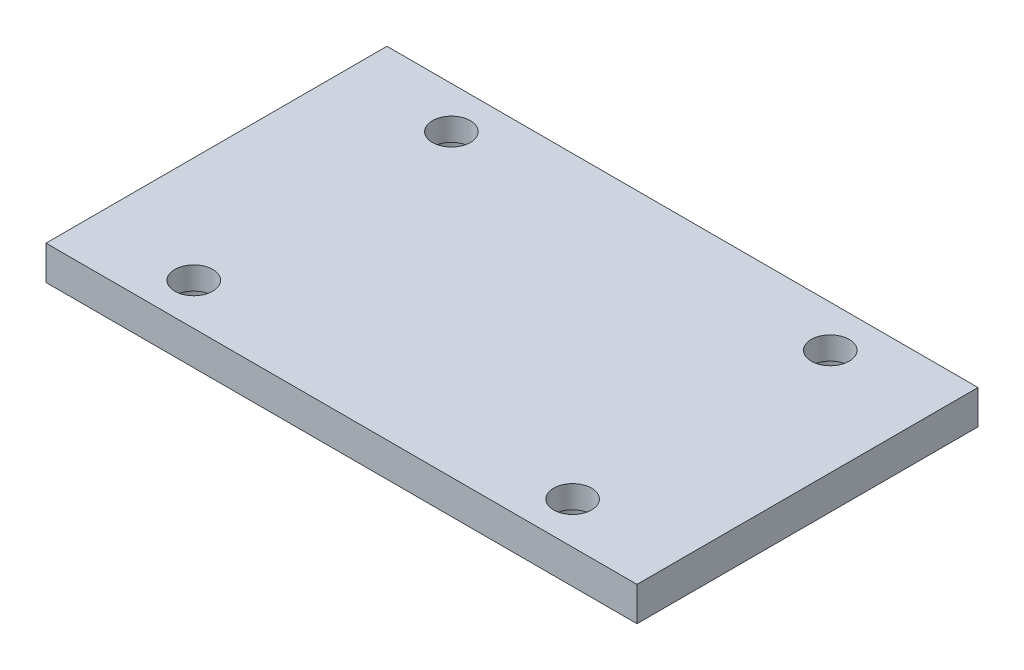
from build123d import *

# Parameters (mm, degrees)
ESBO_O1_W       = 156
ESBO_O1_H       = 90
EXTRUS_O1_DEPTH = 9
ESBO_O2_R       = 5
EXTRUS_O2_DEPTH = 91.498618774
ESBO_O4_R       = 7.5
EXTRUS_O3_DEPTH = 3


with BuildPart() as part:
    # Esbo_o1 → Extrus_o1 (new body)
    with BuildSketch(Plane(origin=(0, 0, 0), x_dir=(1, 0, 0), z_dir=(0, 1, 0))):
        Rectangle(ESBO_O1_W, ESBO_O1_H)
    extrude(amount=EXTRUS_O1_DEPTH)

    # Esbo_o2 → Extrus_o2 (cut, through all)
    with BuildSketch(Plane.XZ):
        with Locations(Location((50, 34, 0), (0, 0, 270))):
            Circle(ESBO_O2_R)
        with Locations(Location((-50, 34, 0), (0, 0, 270))):
            Circle(ESBO_O2_R)
        with Locations(Location((50, -34, 0), (0, 0, 270))):
            Circle(ESBO_O2_R)
        with Locations(Location((-50, -34, 0), (0, 0, 270))):
            Circle(ESBO_O2_R)
    extrude(amount=-EXTRUS_O2_DEPTH, mode=Mode.SUBTRACT)

    # Esbo_o4 → Extrus_o3 (cut)
    with BuildSketch(Plane.XZ):
        with Locations(Location((50, 34, 0), (0, 0, 270))):
            Circle(ESBO_O4_R)
        with Locations(Location((-50, 34, 0), (0, 0, 270))):
            Circle(ESBO_O4_R)
        with Locations(Location((50, -34, 0), (0, 0, 270))):
            Circle(ESBO_O4_R)
        with Locations(Location((-50, -34, 0), (0, 0, 270))):
            Circle(ESBO_O4_R)
    extrude(amount=-EXTRUS_O3_DEPTH, mode=Mode.SUBTRACT)


solid = part.part
